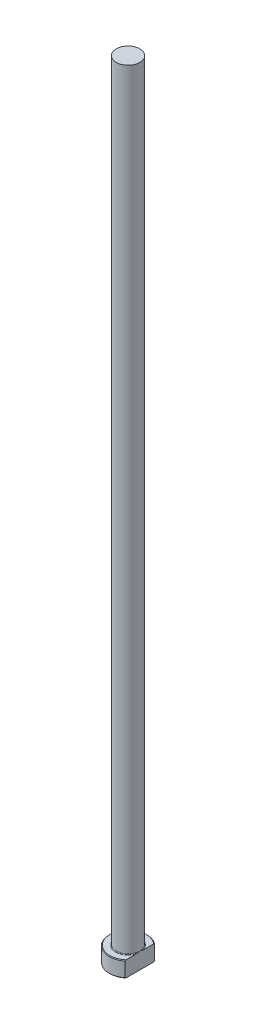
from build123d import *
from build123d.topology import SkipClean

# Parameters (mm, degrees)
CHAMFER1_SIZE = 0.2
FILLET1_R     = 0.2
KEY_DEPTH     = 251.143958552


with BuildPart() as part:
    # Sketch1 → Revolve1 (revolve)
    with BuildSketch(Plane.XY, mode=Mode.PRIVATE) as revolve1_sk:
        Polygon((0, 0), (-6, 0), (-6, 5), (-3.75, 5), (-3.75, 250), (0, 250), align=None)
    revolve(revolve1_sk.sketch.rotate(Axis((0, 259.958771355, 0), (0, -1, 0)), 270), axis=Axis((0, 259.958771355, 0), (0, -1, 0)))

    # Chamfer1
    chamfer1_edges = [part.edges().sort_by_distance(p)[0] for p in [
        (0, 5, -6),
        (0, 0, -6),
    ]]
    chamfer(chamfer1_edges, length=CHAMFER1_SIZE)

    # Fillet1
    fillet1_edges = [part.edges().sort_by_distance(p)[0] for p in [
        (0, 5, -3.75),
    ]]
    fillet(fillet1_edges, radius=FILLET1_R)

    # Sketch2 → KEY (cut, through all)
    with SkipClean():  # the faces are left unmerged after this step: merging them gives an invalid solid
        with BuildSketch(Plane(origin=(0, 0, 0), x_dir=(1, 0, 0), z_dir=(0, 1, 0))):
            with BuildLine():
                Line((3.75, 4.683748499), (3.75, -4.683748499))
                ThreePointArc((3.75, -4.683748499), (6, 0), (3.75, 4.683748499))
            make_face()
        extrude(amount=KEY_DEPTH, mode=Mode.SUBTRACT)


solid = part.part
